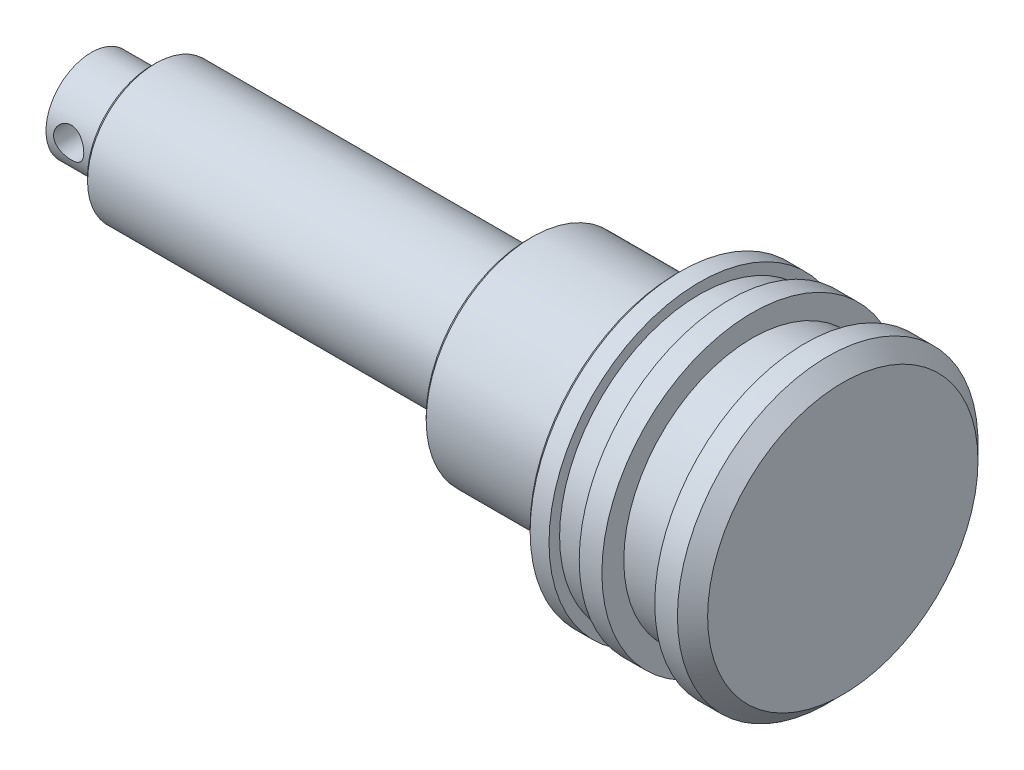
ISO-10303-21;
HEADER;
FILE_DESCRIPTION(('STEP AP214'),'2;1');
FILE_NAME('part.step','',(''),(''),'','','');
FILE_SCHEMA(('AUTOMOTIVE_DESIGN { 1 0 10303 214 1 1 1 1 }'));
ENDSEC;
DATA;
#1=APPLICATION_CONTEXT('core data for automotive mechanical design processes');
#2=APPLICATION_PROTOCOL_DEFINITION('international standard','automotive_design',2000,#1);
#3=PRODUCT_CONTEXT('',#1,'mechanical');
#4=PRODUCT('Part','Part','',(#3));
#5=PRODUCT_RELATED_PRODUCT_CATEGORY('part','',(#4));
#6=PRODUCT_DEFINITION_FORMATION('','',#4);
#7=PRODUCT_DEFINITION_CONTEXT('part definition',#1,'design');
#8=PRODUCT_DEFINITION('design','',#6,#7);
#9=PRODUCT_DEFINITION_SHAPE('','',#8);
#10=(LENGTH_UNIT() NAMED_UNIT(*) SI_UNIT(.MILLI.,.METRE.));
#11=(NAMED_UNIT(*) PLANE_ANGLE_UNIT() SI_UNIT($,.RADIAN.));
#12=(NAMED_UNIT(*) SI_UNIT($,.STERADIAN.) SOLID_ANGLE_UNIT());
#13=UNCERTAINTY_MEASURE_WITH_UNIT(LENGTH_MEASURE(1.E-05),#10,'distance_accuracy_value','');
#14=(GEOMETRIC_REPRESENTATION_CONTEXT(3) GLOBAL_UNCERTAINTY_ASSIGNED_CONTEXT((#13)) GLOBAL_UNIT_ASSIGNED_CONTEXT((#10,
#11,#12)) REPRESENTATION_CONTEXT('',''));
#15=CARTESIAN_POINT('',(0.,0.,0.));
#16=DIRECTION('',(0.,0.,1.));
#17=DIRECTION('',(1.,0.,0.));
#18=AXIS2_PLACEMENT_3D('',#15,#16,#17);
#19=CARTESIAN_POINT('',(0.,0.,0.));
#20=DIRECTION('',(-1.,0.,0.));
#21=DIRECTION('',(0.,0.,1.));
#22=AXIS2_PLACEMENT_3D('',#19,#20,#21);
#23=CYLINDRICAL_SURFACE('',#22,6.);
#24=CARTESIAN_POINT('',(-98.5,0.,-6.00000000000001));
#25=CARTESIAN_POINT('',(-98.5000005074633,0.109126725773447,-6.00000030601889));
#26=CARTESIAN_POINT('',(-98.4910394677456,0.2182503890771,-5.99699539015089));
#27=CARTESIAN_POINT('',(-98.4555417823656,0.433283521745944,-5.98530420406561));
#28=CARTESIAN_POINT('',(-98.4290033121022,0.539192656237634,-5.97661734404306));
#29=CARTESIAN_POINT('',(-98.3593615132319,0.744665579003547,-5.95450615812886));
#30=CARTESIAN_POINT('',(-98.3162858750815,0.84423965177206,-5.94108975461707));
#31=CARTESIAN_POINT('',(-98.2149176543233,1.03474987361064,-5.91088891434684));
#32=CARTESIAN_POINT('',(-98.1566220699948,1.12568431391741,-5.89410381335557));
#33=CARTESIAN_POINT('',(-98.0243483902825,1.29948335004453,-5.85828188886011));
#34=CARTESIAN_POINT('',(-97.949937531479,1.38200740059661,-5.8391911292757));
#35=CARTESIAN_POINT('',(-97.7884656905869,1.53366538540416,-5.80120629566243));
#36=CARTESIAN_POINT('',(-97.701401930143,1.60279637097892,-5.78231226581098));
#37=CARTESIAN_POINT('',(-97.5140297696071,1.72764988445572,-5.74626664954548));
#38=CARTESIAN_POINT('',(-97.4134125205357,1.78292971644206,-5.72918078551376));
#39=CARTESIAN_POINT('',(-97.2036478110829,1.87563774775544,-5.69950610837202));
#40=CARTESIAN_POINT('',(-97.0945029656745,1.91307139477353,-5.68691592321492));
#41=CARTESIAN_POINT('',(-96.8746535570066,1.96774692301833,-5.66822606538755));
#42=CARTESIAN_POINT('',(-96.7641255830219,1.98562689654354,-5.66192191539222));
#43=CARTESIAN_POINT('',(-96.5414724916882,2.00268224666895,-5.65591313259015));
#44=CARTESIAN_POINT('',(-96.4293478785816,2.00186340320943,-5.6562064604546));
#45=CARTESIAN_POINT('',(-96.212126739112,1.98203980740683,-5.66318030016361));
#46=CARTESIAN_POINT('',(-96.106943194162,1.96386782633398,-5.66956831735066));
#47=CARTESIAN_POINT('',(-95.9012131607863,1.91121232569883,-5.68753315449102));
#48=CARTESIAN_POINT('',(-95.8006672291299,1.87672685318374,-5.69911059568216));
#49=CARTESIAN_POINT('',(-95.6051745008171,1.79187811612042,-5.72635822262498));
#50=CARTESIAN_POINT('',(-95.510343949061,1.74126809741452,-5.74209131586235));
#51=CARTESIAN_POINT('',(-95.3302581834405,1.62577821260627,-5.77585117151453));
#52=CARTESIAN_POINT('',(-95.2450057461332,1.560894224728,-5.79387859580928));
#53=CARTESIAN_POINT('',(-95.0818168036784,1.41469866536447,-5.83134658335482));
#54=CARTESIAN_POINT('',(-95.0044946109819,1.33270630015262,-5.85081178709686));
#55=CARTESIAN_POINT('',(-94.8645374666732,1.15667913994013,-5.88813876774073));
#56=CARTESIAN_POINT('',(-94.801903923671,1.06264319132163,-5.90600039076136));
#57=CARTESIAN_POINT('',(-94.6926073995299,0.863895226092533,-5.93834215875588));
#58=CARTESIAN_POINT('',(-94.6461090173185,0.75908655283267,-5.95278700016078));
#59=CARTESIAN_POINT('',(-94.5715936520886,0.542538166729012,-5.9764113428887));
#60=CARTESIAN_POINT('',(-94.5435702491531,0.430800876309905,-5.98559267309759));
#61=CARTESIAN_POINT('',(-94.5078886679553,0.208767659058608,-5.99735254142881));
#62=CARTESIAN_POINT('',(-94.4994003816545,0.0986191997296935,-6.00020003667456));
#63=CARTESIAN_POINT('',(-94.5006653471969,-0.121550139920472,-5.99977805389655));
#64=CARTESIAN_POINT('',(-94.5104155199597,-0.231571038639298,-5.99650960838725));
#65=CARTESIAN_POINT('',(-94.5472238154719,-0.445039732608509,-5.98440049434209));
#66=CARTESIAN_POINT('',(-94.573772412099,-0.548585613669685,-5.97572397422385));
#67=CARTESIAN_POINT('',(-94.6427868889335,-0.749711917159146,-5.9538369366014));
#68=CARTESIAN_POINT('',(-94.6852547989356,-0.847291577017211,-5.94062584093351));
#69=CARTESIAN_POINT('',(-94.7861408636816,-1.03657659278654,-5.9105786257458));
#70=CARTESIAN_POINT('',(-94.8449491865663,-1.12805991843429,-5.89365629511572));
#71=CARTESIAN_POINT('',(-94.976388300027,-1.30012966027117,-5.85810507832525));
#72=CARTESIAN_POINT('',(-95.0490233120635,-1.38071273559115,-5.83947567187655));
#73=CARTESIAN_POINT('',(-95.2099575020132,-1.5325050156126,-5.8015369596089));
#74=CARTESIAN_POINT('',(-95.2988184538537,-1.60312193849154,-5.78223522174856));
#75=CARTESIAN_POINT('',(-95.4875431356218,-1.72851504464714,-5.74599946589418));
#76=CARTESIAN_POINT('',(-95.5874069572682,-1.78329109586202,-5.72906546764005));
#77=CARTESIAN_POINT('',(-95.7953460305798,-1.87519386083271,-5.69964783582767));
#78=CARTESIAN_POINT('',(-95.9034041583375,-1.91235626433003,-5.68715521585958));
#79=CARTESIAN_POINT('',(-96.1247573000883,-1.96778933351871,-5.66821664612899));
#80=CARTESIAN_POINT('',(-96.2380499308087,-1.98606850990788,-5.66176797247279));
#81=CARTESIAN_POINT('',(-96.4603941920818,-2.00255256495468,-5.65595717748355));
#82=CARTESIAN_POINT('',(-96.5693646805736,-2.0017405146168,-5.6562480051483));
#83=CARTESIAN_POINT('',(-96.7855301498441,-1.98248458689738,-5.66302539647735));
#84=CARTESIAN_POINT('',(-96.8927252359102,-1.96404175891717,-5.66951159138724));
#85=CARTESIAN_POINT('',(-97.1002713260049,-1.91074362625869,-5.68769048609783));
#86=CARTESIAN_POINT('',(-97.200713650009,-1.87620669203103,-5.69928196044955));
#87=CARTESIAN_POINT('',(-97.3944548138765,-1.79195873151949,-5.72632797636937));
#88=CARTESIAN_POINT('',(-97.487752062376,-1.74224433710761,-5.74178337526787));
#89=CARTESIAN_POINT('',(-97.6689673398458,-1.62652138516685,-5.77565658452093));
#90=CARTESIAN_POINT('',(-97.7564730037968,-1.55989648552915,-5.79417423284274));
#91=CARTESIAN_POINT('',(-97.9193796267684,-1.41328576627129,-5.83166712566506));
#92=CARTESIAN_POINT('',(-97.9947771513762,-1.33329616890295,-5.85064249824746));
#93=CARTESIAN_POINT('',(-98.1342888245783,-1.15848311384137,-5.88780061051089));
#94=CARTESIAN_POINT('',(-98.197848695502,-1.06320302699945,-5.90592363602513));
#95=CARTESIAN_POINT('',(-98.3079808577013,-0.862714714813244,-5.93851982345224));
#96=CARTESIAN_POINT('',(-98.3545574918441,-0.757509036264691,-5.9529939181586));
#97=CARTESIAN_POINT('',(-98.4274432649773,-0.544987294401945,-5.97611030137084));
#98=CARTESIAN_POINT('',(-98.4545649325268,-0.437975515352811,-5.98498424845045));
#99=CARTESIAN_POINT('',(-98.4908405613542,-0.22064083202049,-5.99692814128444));
#100=CARTESIAN_POINT('',(-98.4999994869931,-0.110318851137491,-5.99999969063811));
#101=CARTESIAN_POINT('',(-98.5,0.,-6.00000000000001));
#102=B_SPLINE_CURVE_WITH_KNOTS('',3,(#24,#25,#26,#27,#28,#29,#30,#31,#32,#33,#34,#35,#36,#37,
#38,#39,#40,#41,#42,#43,#44,#45,#46,#47,#48,#49,#50,#51,#52,#53,#54,#55,#56,#57,#58,#59,#60,#61,
#62,#63,#64,#65,#66,#67,#68,#69,#70,#71,#72,#73,#74,#75,#76,#77,#78,#79,#80,#81,#82,#83,#84,#85,
#86,#87,#88,#89,#90,#91,#92,#93,#94,#95,#96,#97,#98,#99,#100,#101),.UNSPECIFIED.,.T.,.F.,(4,2,2,
2,2,2,2,2,2,2,2,2,2,2,2,2,2,2,2,2,2,2,2,2,2,2,2,2,2,2,2,2,2,2,2,2,2,2,4),(0.,0.326974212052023,
0.653982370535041,0.980445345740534,1.30697275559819,1.64369368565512,1.98048866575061,
2.32696769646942,2.67334089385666,3.00803851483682,3.34263267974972,3.66193653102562,
3.98127861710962,4.30576342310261,4.63034205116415,4.97186611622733,5.31342291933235,
5.65836811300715,6.00319337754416,6.33307166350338,6.66289426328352,6.98316315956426,
7.30347290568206,7.63220799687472,7.96104361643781,8.30482045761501,8.64860016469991,
8.99168027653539,9.33460569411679,9.65991332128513,9.98520158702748,10.3043117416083,
10.6234927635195,10.9566013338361,11.2898042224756,11.635993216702,11.9820936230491,
12.3127311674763,12.6432773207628),.UNSPECIFIED.);
#103=CARTESIAN_POINT('',(-98.5,0.,-6.00000000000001));
#104=VERTEX_POINT('',#103);
#105=EDGE_CURVE('E64',#104,#104,#102,.T.);
#106=ORIENTED_EDGE('',*,*,#105,.F.);
#107=EDGE_LOOP('',(#106));
#108=FACE_BOUND('',#107,.T.);
#109=CARTESIAN_POINT('',(-99.5,0.,0.));
#110=DIRECTION('',(-1.,0.,0.));
#111=DIRECTION('',(0.,0.,1.));
#112=AXIS2_PLACEMENT_3D('',#109,#110,#111);
#113=CIRCLE('',#112,6.);
#114=CARTESIAN_POINT('',(-99.5,0.,6.));
#115=VERTEX_POINT('',#114);
#116=EDGE_CURVE('E56',#115,#115,#113,.T.);
#117=ORIENTED_EDGE('',*,*,#116,.F.);
#118=EDGE_LOOP('',(#117));
#119=FACE_BOUND('',#118,.T.);
#120=CARTESIAN_POINT('',(-91.5,0.,0.));
#121=DIRECTION('',(-1.,0.,0.));
#122=DIRECTION('',(0.,0.,1.));
#123=AXIS2_PLACEMENT_3D('',#120,#121,#122);
#124=CIRCLE('',#123,6.);
#125=CARTESIAN_POINT('',(-91.5,0.,6.00000000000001));
#126=VERTEX_POINT('',#125);
#127=EDGE_CURVE('E58',#126,#126,#124,.T.);
#128=ORIENTED_EDGE('',*,*,#127,.T.);
#129=EDGE_LOOP('',(#128));
#130=FACE_BOUND('',#129,.T.);
#131=CARTESIAN_POINT('',(-94.5,0.,6.00000000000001));
#132=CARTESIAN_POINT('',(-94.4999994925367,0.109126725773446,6.00000030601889));
#133=CARTESIAN_POINT('',(-94.5089605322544,0.218250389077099,5.99699539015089));
#134=CARTESIAN_POINT('',(-94.5444582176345,0.433283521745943,5.98530420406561));
#135=CARTESIAN_POINT('',(-94.5709966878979,0.539192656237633,5.97661734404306));
#136=CARTESIAN_POINT('',(-94.6406384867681,0.744665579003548,5.95450615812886));
#137=CARTESIAN_POINT('',(-94.6837141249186,0.844239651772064,5.94108975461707));
#138=CARTESIAN_POINT('',(-94.7850823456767,1.03474987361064,5.91088891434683));
#139=CARTESIAN_POINT('',(-94.8433779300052,1.12568431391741,5.89410381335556));
#140=CARTESIAN_POINT('',(-94.9756516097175,1.29948335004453,5.85828188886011));
#141=CARTESIAN_POINT('',(-95.050062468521,1.38200740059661,5.8391911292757));
#142=CARTESIAN_POINT('',(-95.2115343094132,1.53366538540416,5.80120629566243));
#143=CARTESIAN_POINT('',(-95.298598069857,1.60279637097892,5.78231226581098));
#144=CARTESIAN_POINT('',(-95.4859702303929,1.72764988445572,5.74626664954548));
#145=CARTESIAN_POINT('',(-95.5865874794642,1.78292971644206,5.72918078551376));
#146=CARTESIAN_POINT('',(-95.7963521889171,1.87563774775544,5.69950610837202));
#147=CARTESIAN_POINT('',(-95.9054970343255,1.91307139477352,5.68691592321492));
#148=CARTESIAN_POINT('',(-96.1253464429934,1.96774692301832,5.66822606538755));
#149=CARTESIAN_POINT('',(-96.2358744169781,1.98562689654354,5.66192191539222));
#150=CARTESIAN_POINT('',(-96.4585275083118,2.00268224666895,5.65591313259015));
#151=CARTESIAN_POINT('',(-96.5706521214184,2.00186340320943,5.6562064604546));
#152=CARTESIAN_POINT('',(-96.7878732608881,1.98203980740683,5.66318030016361));
#153=CARTESIAN_POINT('',(-96.8930568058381,1.96386782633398,5.66956831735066));
#154=CARTESIAN_POINT('',(-97.0987868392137,1.91121232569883,5.68753315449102));
#155=CARTESIAN_POINT('',(-97.1993327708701,1.87672685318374,5.69911059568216));
#156=CARTESIAN_POINT('',(-97.3948254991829,1.79187811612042,5.72635822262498));
#157=CARTESIAN_POINT('',(-97.489656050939,1.74126809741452,5.74209131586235));
#158=CARTESIAN_POINT('',(-97.6697418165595,1.62577821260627,5.77585117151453));
#159=CARTESIAN_POINT('',(-97.7549942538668,1.560894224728,5.79387859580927));
#160=CARTESIAN_POINT('',(-97.9181831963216,1.41469866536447,5.83134658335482));
#161=CARTESIAN_POINT('',(-97.9955053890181,1.33270630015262,5.85081178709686));
#162=CARTESIAN_POINT('',(-98.1354625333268,1.15667913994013,5.88813876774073));
#163=CARTESIAN_POINT('',(-98.198096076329,1.06264319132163,5.90600039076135));
#164=CARTESIAN_POINT('',(-98.3073926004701,0.863895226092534,5.93834215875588));
#165=CARTESIAN_POINT('',(-98.3538909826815,0.759086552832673,5.95278700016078));
#166=CARTESIAN_POINT('',(-98.4284063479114,0.542538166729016,5.9764113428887));
#167=CARTESIAN_POINT('',(-98.4564297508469,0.430800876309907,5.98559267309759));
#168=CARTESIAN_POINT('',(-98.4921113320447,0.208767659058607,5.99735254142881));
#169=CARTESIAN_POINT('',(-98.5005996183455,0.0986191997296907,6.00020003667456));
#170=CARTESIAN_POINT('',(-98.4993346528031,-0.121550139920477,5.99977805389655));
#171=CARTESIAN_POINT('',(-98.4895844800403,-0.231571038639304,5.99650960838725));
#172=CARTESIAN_POINT('',(-98.4527761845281,-0.445039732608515,5.98440049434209));
#173=CARTESIAN_POINT('',(-98.426227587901,-0.548585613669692,5.97572397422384));
#174=CARTESIAN_POINT('',(-98.3572131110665,-0.749711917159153,5.9538369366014));
#175=CARTESIAN_POINT('',(-98.3147452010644,-0.847291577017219,5.9406258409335));
#176=CARTESIAN_POINT('',(-98.2138591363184,-1.03657659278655,5.9105786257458));
#177=CARTESIAN_POINT('',(-98.1550508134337,-1.12805991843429,5.89365629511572));
#178=CARTESIAN_POINT('',(-98.023611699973,-1.30012966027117,5.85810507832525));
#179=CARTESIAN_POINT('',(-97.9509766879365,-1.38071273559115,5.83947567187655));
#180=CARTESIAN_POINT('',(-97.7900424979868,-1.5325050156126,5.8015369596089));
#181=CARTESIAN_POINT('',(-97.7011815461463,-1.60312193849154,5.78223522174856));
#182=CARTESIAN_POINT('',(-97.5124568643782,-1.72851504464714,5.74599946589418));
#183=CARTESIAN_POINT('',(-97.4125930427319,-1.78329109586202,5.72906546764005));
#184=CARTESIAN_POINT('',(-97.2046539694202,-1.87519386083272,5.69964783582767));
#185=CARTESIAN_POINT('',(-97.0965958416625,-1.91235626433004,5.68715521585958));
#186=CARTESIAN_POINT('',(-96.8752426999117,-1.96778933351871,5.66821664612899));
#187=CARTESIAN_POINT('',(-96.7619500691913,-1.98606850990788,5.66176797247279));
#188=CARTESIAN_POINT('',(-96.5396058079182,-2.00255256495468,5.65595717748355));
#189=CARTESIAN_POINT('',(-96.4306353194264,-2.0017405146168,5.6562480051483));
#190=CARTESIAN_POINT('',(-96.2144698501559,-1.98248458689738,5.66302539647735));
#191=CARTESIAN_POINT('',(-96.1072747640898,-1.96404175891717,5.66951159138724));
#192=CARTESIAN_POINT('',(-95.8997286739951,-1.91074362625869,5.68769048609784));
#193=CARTESIAN_POINT('',(-95.799286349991,-1.87620669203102,5.69928196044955));
#194=CARTESIAN_POINT('',(-95.6055451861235,-1.79195873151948,5.72632797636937));
#195=CARTESIAN_POINT('',(-95.512247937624,-1.7422443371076,5.74178337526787));
#196=CARTESIAN_POINT('',(-95.3310326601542,-1.62652138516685,5.77565658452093));
#197=CARTESIAN_POINT('',(-95.2435269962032,-1.55989648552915,5.79417423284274));
#198=CARTESIAN_POINT('',(-95.0806203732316,-1.41328576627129,5.83166712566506));
#199=CARTESIAN_POINT('',(-95.0052228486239,-1.33329616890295,5.85064249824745));
#200=CARTESIAN_POINT('',(-94.8657111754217,-1.15848311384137,5.88780061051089));
#201=CARTESIAN_POINT('',(-94.802151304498,-1.06320302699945,5.90592363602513));
#202=CARTESIAN_POINT('',(-94.6920191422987,-0.862714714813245,5.93851982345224));
#203=CARTESIAN_POINT('',(-94.6454425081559,-0.757509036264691,5.9529939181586));
#204=CARTESIAN_POINT('',(-94.5725567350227,-0.544987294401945,5.97611030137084));
#205=CARTESIAN_POINT('',(-94.5454350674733,-0.437975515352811,5.98498424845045));
#206=CARTESIAN_POINT('',(-94.5091594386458,-0.22064083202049,5.99692814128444));
#207=CARTESIAN_POINT('',(-94.5000005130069,-0.110318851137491,5.9999996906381));
#208=CARTESIAN_POINT('',(-94.5,0.,6.00000000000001));
#209=B_SPLINE_CURVE_WITH_KNOTS('',3,(#131,#132,#133,#134,#135,#136,#137,#138,#139,#140,#141,
#142,#143,#144,#145,#146,#147,#148,#149,#150,#151,#152,#153,#154,#155,#156,#157,#158,#159,#160,
#161,#162,#163,#164,#165,#166,#167,#168,#169,#170,#171,#172,#173,#174,#175,#176,#177,#178,#179,
#180,#181,#182,#183,#184,#185,#186,#187,#188,#189,#190,#191,#192,#193,#194,#195,#196,#197,#198,
#199,#200,#201,#202,#203,#204,#205,#206,#207,#208),.UNSPECIFIED.,.T.,.F.,(4,2,2,2,2,2,2,2,2,2,2,
2,2,2,2,2,2,2,2,2,2,2,2,2,2,2,2,2,2,2,2,2,2,2,2,2,2,2,4),(0.,0.326974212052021,
0.653982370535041,0.980445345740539,1.30697275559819,1.64369368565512,1.98048866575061,
2.32696769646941,2.67334089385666,3.00803851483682,3.34263267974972,3.66193653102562,
3.98127861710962,4.30576342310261,4.63034205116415,4.97186611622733,5.31342291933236,
5.65836811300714,6.00319337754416,6.33307166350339,6.66289426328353,6.98316315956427,
7.30347290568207,7.63220799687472,7.96104361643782,8.30482045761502,8.64860016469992,
8.9916802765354,9.33460569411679,9.65991332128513,9.98520158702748,10.3043117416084,
10.6234927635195,10.9566013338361,11.2898042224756,11.635993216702,11.9820936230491,
12.3127311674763,12.6432773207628),.UNSPECIFIED.);
#210=CARTESIAN_POINT('',(-94.5,0.,6.00000000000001));
#211=VERTEX_POINT('',#210);
#212=EDGE_CURVE('E36',#211,#211,#209,.T.);
#213=ORIENTED_EDGE('',*,*,#212,.F.);
#214=EDGE_LOOP('',(#213));
#215=FACE_BOUND('',#214,.T.);
#216=ADVANCED_FACE('F32',(#108,#119,#130,#215),#23,.T.);
#217=CARTESIAN_POINT('',(0.,0.,0.));
#218=DIRECTION('',(-1.,0.,0.));
#219=DIRECTION('',(0.,0.,1.));
#220=AXIS2_PLACEMENT_3D('',#217,#218,#219);
#221=PLANE('',#220);
#222=CARTESIAN_POINT('',(0.,0.,0.));
#223=DIRECTION('',(-1.,0.,0.));
#224=DIRECTION('',(0.,0.,1.));
#225=AXIS2_PLACEMENT_3D('',#222,#223,#224);
#226=CIRCLE('',#225,17.9000000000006);
#227=CARTESIAN_POINT('',(0.,0.,17.9000000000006));
#228=VERTEX_POINT('',#227);
#229=EDGE_CURVE('E11',#228,#228,#226,.T.);
#230=ORIENTED_EDGE('',*,*,#229,.F.);
#231=EDGE_LOOP('',(#230));
#232=FACE_BOUND('',#231,.T.);
#233=ADVANCED_FACE('F34',(#232),#221,.F.);
#234=CARTESIAN_POINT('',(0.,0.,0.));
#235=DIRECTION('',(-1.,0.,0.));
#236=DIRECTION('',(0.,0.,1.));
#237=AXIS2_PLACEMENT_3D('',#234,#235,#236);
#238=CONICAL_SURFACE('',#237,17.9000000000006,0.785398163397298);
#239=CARTESIAN_POINT('',(-2.,0.,0.));
#240=DIRECTION('',(-1.,0.,0.));
#241=DIRECTION('',(0.,0.,1.));
#242=AXIS2_PLACEMENT_3D('',#239,#240,#241);
#243=CIRCLE('',#242,19.9);
#244=CARTESIAN_POINT('',(-2.,0.,19.9));
#245=VERTEX_POINT('',#244);
#246=EDGE_CURVE('E44',#245,#245,#243,.T.);
#247=ORIENTED_EDGE('',*,*,#246,.F.);
#248=EDGE_LOOP('',(#247));
#249=FACE_BOUND('',#248,.T.);
#250=ORIENTED_EDGE('',*,*,#229,.T.);
#251=EDGE_LOOP('',(#250));
#252=FACE_BOUND('',#251,.T.);
#253=ADVANCED_FACE('F132',(#249,#252),#238,.T.);
#254=CARTESIAN_POINT('',(0.,0.,0.));
#255=DIRECTION('',(-1.,0.,0.));
#256=DIRECTION('',(0.,0.,1.));
#257=AXIS2_PLACEMENT_3D('',#254,#255,#256);
#258=CYLINDRICAL_SURFACE('',#257,19.9);
#259=CARTESIAN_POINT('',(-5.,0.,0.));
#260=DIRECTION('',(-1.,0.,0.));
#261=DIRECTION('',(0.,0.,1.));
#262=AXIS2_PLACEMENT_3D('',#259,#260,#261);
#263=CIRCLE('',#262,19.9);
#264=CARTESIAN_POINT('',(-5.,0.,19.9));
#265=VERTEX_POINT('',#264);
#266=EDGE_CURVE('E111',#265,#265,#263,.T.);
#267=ORIENTED_EDGE('',*,*,#266,.F.);
#268=EDGE_LOOP('',(#267));
#269=FACE_BOUND('',#268,.T.);
#270=ORIENTED_EDGE('',*,*,#246,.T.);
#271=EDGE_LOOP('',(#270));
#272=FACE_BOUND('',#271,.T.);
#273=ADVANCED_FACE('F231',(#269,#272),#258,.T.);
#274=CARTESIAN_POINT('',(-5.,19.9,0.));
#275=DIRECTION('',(1.,0.,0.));
#276=DIRECTION('',(0.,0.,-1.));
#277=AXIS2_PLACEMENT_3D('',#274,#275,#276);
#278=PLANE('',#277);
#279=CARTESIAN_POINT('',(-5.,0.,0.));
#280=DIRECTION('',(-1.,0.,0.));
#281=DIRECTION('',(0.,0.,1.));
#282=AXIS2_PLACEMENT_3D('',#279,#280,#281);
#283=CIRCLE('',#282,17.);
#284=CARTESIAN_POINT('',(-5.,0.,17.));
#285=VERTEX_POINT('',#284);
#286=EDGE_CURVE('E108',#285,#285,#283,.T.);
#287=ORIENTED_EDGE('',*,*,#286,.F.);
#288=EDGE_LOOP('',(#287));
#289=FACE_BOUND('',#288,.T.);
#290=ORIENTED_EDGE('',*,*,#266,.T.);
#291=EDGE_LOOP('',(#290));
#292=FACE_BOUND('',#291,.T.);
#293=ADVANCED_FACE('F225',(#289,#292),#278,.F.);
#294=CARTESIAN_POINT('',(0.,0.,0.));
#295=DIRECTION('',(-1.,0.,0.));
#296=DIRECTION('',(0.,0.,1.));
#297=AXIS2_PLACEMENT_3D('',#294,#295,#296);
#298=CYLINDRICAL_SURFACE('',#297,17.);
#299=CARTESIAN_POINT('',(-12.,0.,0.));
#300=DIRECTION('',(-1.,0.,0.));
#301=DIRECTION('',(0.,0.,1.));
#302=AXIS2_PLACEMENT_3D('',#299,#300,#301);
#303=CIRCLE('',#302,17.);
#304=CARTESIAN_POINT('',(-12.,0.,17.));
#305=VERTEX_POINT('',#304);
#306=EDGE_CURVE('E105',#305,#305,#303,.T.);
#307=ORIENTED_EDGE('',*,*,#306,.F.);
#308=EDGE_LOOP('',(#307));
#309=FACE_BOUND('',#308,.T.);
#310=ORIENTED_EDGE('',*,*,#286,.T.);
#311=EDGE_LOOP('',(#310));
#312=FACE_BOUND('',#311,.T.);
#313=ADVANCED_FACE('F219',(#309,#312),#298,.T.);
#314=CARTESIAN_POINT('',(-12.,17.,0.));
#315=DIRECTION('',(-1.,0.,0.));
#316=DIRECTION('',(0.,0.,1.));
#317=AXIS2_PLACEMENT_3D('',#314,#315,#316);
#318=PLANE('',#317);
#319=CARTESIAN_POINT('',(-12.,0.,0.));
#320=DIRECTION('',(-1.,0.,0.));
#321=DIRECTION('',(0.,0.,1.));
#322=AXIS2_PLACEMENT_3D('',#319,#320,#321);
#323=CIRCLE('',#322,19.9);
#324=CARTESIAN_POINT('',(-12.,0.,19.9));
#325=VERTEX_POINT('',#324);
#326=EDGE_CURVE('E102',#325,#325,#323,.T.);
#327=ORIENTED_EDGE('',*,*,#326,.F.);
#328=EDGE_LOOP('',(#327));
#329=FACE_BOUND('',#328,.T.);
#330=ORIENTED_EDGE('',*,*,#306,.T.);
#331=EDGE_LOOP('',(#330));
#332=FACE_BOUND('',#331,.T.);
#333=ADVANCED_FACE('F213',(#329,#332),#318,.F.);
#334=CARTESIAN_POINT('',(0.,0.,0.));
#335=DIRECTION('',(-1.,0.,0.));
#336=DIRECTION('',(0.,0.,1.));
#337=AXIS2_PLACEMENT_3D('',#334,#335,#336);
#338=CYLINDRICAL_SURFACE('',#337,19.9);
#339=CARTESIAN_POINT('',(-15.,0.,0.));
#340=DIRECTION('',(-1.,0.,0.));
#341=DIRECTION('',(0.,0.,1.));
#342=AXIS2_PLACEMENT_3D('',#339,#340,#341);
#343=CIRCLE('',#342,19.9);
#344=CARTESIAN_POINT('',(-15.,0.,19.9));
#345=VERTEX_POINT('',#344);
#346=EDGE_CURVE('E99',#345,#345,#343,.T.);
#347=ORIENTED_EDGE('',*,*,#346,.F.);
#348=EDGE_LOOP('',(#347));
#349=FACE_BOUND('',#348,.T.);
#350=ORIENTED_EDGE('',*,*,#326,.T.);
#351=EDGE_LOOP('',(#350));
#352=FACE_BOUND('',#351,.T.);
#353=ADVANCED_FACE('F207',(#349,#352),#338,.T.);
#354=CARTESIAN_POINT('',(-15.,19.9,0.));
#355=DIRECTION('',(1.,0.,0.));
#356=DIRECTION('',(0.,0.,-1.));
#357=AXIS2_PLACEMENT_3D('',#354,#355,#356);
#358=PLANE('',#357);
#359=CARTESIAN_POINT('',(-15.,0.,0.));
#360=DIRECTION('',(-1.,0.,0.));
#361=DIRECTION('',(0.,0.,1.));
#362=AXIS2_PLACEMENT_3D('',#359,#360,#361);
#363=CIRCLE('',#362,18.5);
#364=CARTESIAN_POINT('',(-15.,0.,18.5));
#365=VERTEX_POINT('',#364);
#366=EDGE_CURVE('E95',#365,#365,#363,.T.);
#367=ORIENTED_EDGE('',*,*,#366,.F.);
#368=EDGE_LOOP('',(#367));
#369=FACE_BOUND('',#368,.T.);
#370=ORIENTED_EDGE('',*,*,#346,.T.);
#371=EDGE_LOOP('',(#370));
#372=FACE_BOUND('',#371,.T.);
#373=ADVANCED_FACE('F201',(#369,#372),#358,.F.);
#374=CARTESIAN_POINT('',(0.,0.,0.));
#375=DIRECTION('',(-1.,0.,0.));
#376=DIRECTION('',(0.,0.,1.));
#377=AXIS2_PLACEMENT_3D('',#374,#375,#376);
#378=CYLINDRICAL_SURFACE('',#377,18.5);
#379=CARTESIAN_POINT('',(-19.,0.,0.));
#380=DIRECTION('',(-1.,0.,0.));
#381=DIRECTION('',(0.,0.,1.));
#382=AXIS2_PLACEMENT_3D('',#379,#380,#381);
#383=CIRCLE('',#382,18.5);
#384=CARTESIAN_POINT('',(-19.,0.,18.5));
#385=VERTEX_POINT('',#384);
#386=EDGE_CURVE('E92',#385,#385,#383,.T.);
#387=ORIENTED_EDGE('',*,*,#386,.F.);
#388=EDGE_LOOP('',(#387));
#389=FACE_BOUND('',#388,.T.);
#390=ORIENTED_EDGE('',*,*,#366,.T.);
#391=EDGE_LOOP('',(#390));
#392=FACE_BOUND('',#391,.T.);
#393=ADVANCED_FACE('F195',(#389,#392),#378,.T.);
#394=CARTESIAN_POINT('',(-19.,18.5,0.));
#395=DIRECTION('',(-1.,0.,0.));
#396=DIRECTION('',(0.,0.,1.));
#397=AXIS2_PLACEMENT_3D('',#394,#395,#396);
#398=PLANE('',#397);
#399=CARTESIAN_POINT('',(-19.,0.,0.));
#400=DIRECTION('',(-1.,0.,0.));
#401=DIRECTION('',(0.,0.,1.));
#402=AXIS2_PLACEMENT_3D('',#399,#400,#401);
#403=CIRCLE('',#402,19.9);
#404=CARTESIAN_POINT('',(-19.,0.,19.9));
#405=VERTEX_POINT('',#404);
#406=EDGE_CURVE('E89',#405,#405,#403,.T.);
#407=ORIENTED_EDGE('',*,*,#406,.F.);
#408=EDGE_LOOP('',(#407));
#409=FACE_BOUND('',#408,.T.);
#410=ORIENTED_EDGE('',*,*,#386,.T.);
#411=EDGE_LOOP('',(#410));
#412=FACE_BOUND('',#411,.T.);
#413=ADVANCED_FACE('F189',(#409,#412),#398,.F.);
#414=CARTESIAN_POINT('',(0.,0.,0.));
#415=DIRECTION('',(-1.,0.,0.));
#416=DIRECTION('',(0.,0.,1.));
#417=AXIS2_PLACEMENT_3D('',#414,#415,#416);
#418=CYLINDRICAL_SURFACE('',#417,19.9);
#419=CARTESIAN_POINT('',(-21.5,0.,0.));
#420=DIRECTION('',(-1.,0.,0.));
#421=DIRECTION('',(0.,0.,1.));
#422=AXIS2_PLACEMENT_3D('',#419,#420,#421);
#423=CIRCLE('',#422,19.9);
#424=CARTESIAN_POINT('',(-21.5,0.,19.9));
#425=VERTEX_POINT('',#424);
#426=EDGE_CURVE('E86',#425,#425,#423,.T.);
#427=ORIENTED_EDGE('',*,*,#426,.F.);
#428=EDGE_LOOP('',(#427));
#429=FACE_BOUND('',#428,.T.);
#430=ORIENTED_EDGE('',*,*,#406,.T.);
#431=EDGE_LOOP('',(#430));
#432=FACE_BOUND('',#431,.T.);
#433=ADVANCED_FACE('F183',(#429,#432),#418,.T.);
#434=CARTESIAN_POINT('',(-21.5,0.,0.));
#435=DIRECTION('',(1.,0.,0.));
#436=DIRECTION('',(0.,0.,-1.));
#437=AXIS2_PLACEMENT_3D('',#434,#435,#436);
#438=CONICAL_SURFACE('',#437,19.9,0.785398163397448);
#439=CARTESIAN_POINT('',(-22.,0.,0.));
#440=DIRECTION('',(-1.,0.,0.));
#441=DIRECTION('',(0.,0.,1.));
#442=AXIS2_PLACEMENT_3D('',#439,#440,#441);
#443=CIRCLE('',#442,19.4);
#444=CARTESIAN_POINT('',(-22.,0.,19.4));
#445=VERTEX_POINT('',#444);
#446=EDGE_CURVE('E83',#445,#445,#443,.T.);
#447=ORIENTED_EDGE('',*,*,#446,.F.);
#448=EDGE_LOOP('',(#447));
#449=FACE_BOUND('',#448,.T.);
#450=ORIENTED_EDGE('',*,*,#426,.T.);
#451=EDGE_LOOP('',(#450));
#452=FACE_BOUND('',#451,.T.);
#453=ADVANCED_FACE('F177',(#449,#452),#438,.T.);
#454=CARTESIAN_POINT('',(-22.,19.4,0.));
#455=DIRECTION('',(1.,0.,0.));
#456=DIRECTION('',(0.,0.,-1.));
#457=AXIS2_PLACEMENT_3D('',#454,#455,#456);
#458=PLANE('',#457);
#459=CARTESIAN_POINT('',(-22.,0.,0.));
#460=DIRECTION('',(-1.,0.,0.));
#461=DIRECTION('',(0.,0.,1.));
#462=AXIS2_PLACEMENT_3D('',#459,#460,#461);
#463=CIRCLE('',#462,14.);
#464=CARTESIAN_POINT('',(-22.,0.,14.));
#465=VERTEX_POINT('',#464);
#466=EDGE_CURVE('E80',#465,#465,#463,.T.);
#467=ORIENTED_EDGE('',*,*,#466,.F.);
#468=EDGE_LOOP('',(#467));
#469=FACE_BOUND('',#468,.T.);
#470=ORIENTED_EDGE('',*,*,#446,.T.);
#471=EDGE_LOOP('',(#470));
#472=FACE_BOUND('',#471,.T.);
#473=ADVANCED_FACE('F171',(#469,#472),#458,.F.);
#474=CARTESIAN_POINT('',(0.,0.,0.));
#475=DIRECTION('',(-1.,0.,0.));
#476=DIRECTION('',(0.,0.,1.));
#477=AXIS2_PLACEMENT_3D('',#474,#475,#476);
#478=CYLINDRICAL_SURFACE('',#477,14.);
#479=CARTESIAN_POINT('',(-41.16,0.,0.));
#480=DIRECTION('',(-1.,0.,0.));
#481=DIRECTION('',(0.,0.,1.));
#482=AXIS2_PLACEMENT_3D('',#479,#480,#481);
#483=CIRCLE('',#482,14.);
#484=CARTESIAN_POINT('',(-41.16,0.,14.));
#485=VERTEX_POINT('',#484);
#486=EDGE_CURVE('E77',#485,#485,#483,.T.);
#487=ORIENTED_EDGE('',*,*,#486,.F.);
#488=EDGE_LOOP('',(#487));
#489=FACE_BOUND('',#488,.T.);
#490=ORIENTED_EDGE('',*,*,#466,.T.);
#491=EDGE_LOOP('',(#490));
#492=FACE_BOUND('',#491,.T.);
#493=ADVANCED_FACE('F165',(#489,#492),#478,.T.);
#494=CARTESIAN_POINT('',(-41.16,0.,0.));
#495=DIRECTION('',(1.,0.,0.));
#496=DIRECTION('',(0.,0.,-1.));
#497=AXIS2_PLACEMENT_3D('',#494,#495,#496);
#498=CONICAL_SURFACE('',#497,14.,0.785398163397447);
#499=CARTESIAN_POINT('',(-41.66,0.,0.));
#500=DIRECTION('',(-1.,0.,0.));
#501=DIRECTION('',(0.,0.,1.));
#502=AXIS2_PLACEMENT_3D('',#499,#500,#501);
#503=CIRCLE('',#502,13.5);
#504=CARTESIAN_POINT('',(-41.66,0.,13.5));
#505=VERTEX_POINT('',#504);
#506=EDGE_CURVE('E74',#505,#505,#503,.T.);
#507=ORIENTED_EDGE('',*,*,#506,.F.);
#508=EDGE_LOOP('',(#507));
#509=FACE_BOUND('',#508,.T.);
#510=ORIENTED_EDGE('',*,*,#486,.T.);
#511=EDGE_LOOP('',(#510));
#512=FACE_BOUND('',#511,.T.);
#513=ADVANCED_FACE('F159',(#509,#512),#498,.T.);
#514=CARTESIAN_POINT('',(-41.66,13.5,0.));
#515=DIRECTION('',(1.,0.,0.));
#516=DIRECTION('',(0.,0.,-1.));
#517=AXIS2_PLACEMENT_3D('',#514,#515,#516);
#518=PLANE('',#517);
#519=CARTESIAN_POINT('',(-41.66,0.,0.));
#520=DIRECTION('',(-1.,0.,0.));
#521=DIRECTION('',(0.,0.,1.));
#522=AXIS2_PLACEMENT_3D('',#519,#520,#521);
#523=CIRCLE('',#522,9.);
#524=CARTESIAN_POINT('',(-41.66,0.,9.00000000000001));
#525=VERTEX_POINT('',#524);
#526=EDGE_CURVE('E71',#525,#525,#523,.T.);
#527=ORIENTED_EDGE('',*,*,#526,.F.);
#528=EDGE_LOOP('',(#527));
#529=FACE_BOUND('',#528,.T.);
#530=ORIENTED_EDGE('',*,*,#506,.T.);
#531=EDGE_LOOP('',(#530));
#532=FACE_BOUND('',#531,.T.);
#533=ADVANCED_FACE('F153',(#529,#532),#518,.F.);
#534=CARTESIAN_POINT('',(0.,0.,0.));
#535=DIRECTION('',(-1.,0.,0.));
#536=DIRECTION('',(0.,0.,1.));
#537=AXIS2_PLACEMENT_3D('',#534,#535,#536);
#538=CYLINDRICAL_SURFACE('',#537,9.);
#539=CARTESIAN_POINT('',(-91.,0.,0.));
#540=DIRECTION('',(-1.,0.,0.));
#541=DIRECTION('',(0.,0.,1.));
#542=AXIS2_PLACEMENT_3D('',#539,#540,#541);
#543=CIRCLE('',#542,8.99999999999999);
#544=CARTESIAN_POINT('',(-91.,0.,9.));
#545=VERTEX_POINT('',#544);
#546=EDGE_CURVE('E68',#545,#545,#543,.T.);
#547=ORIENTED_EDGE('',*,*,#546,.F.);
#548=EDGE_LOOP('',(#547));
#549=FACE_BOUND('',#548,.T.);
#550=ORIENTED_EDGE('',*,*,#526,.T.);
#551=EDGE_LOOP('',(#550));
#552=FACE_BOUND('',#551,.T.);
#553=ADVANCED_FACE('F147',(#549,#552),#538,.T.);
#554=CARTESIAN_POINT('',(-91.,0.,0.));
#555=DIRECTION('',(1.,0.,0.));
#556=DIRECTION('',(0.,0.,-1.));
#557=AXIS2_PLACEMENT_3D('',#554,#555,#556);
#558=CONICAL_SURFACE('',#557,8.99999999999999,0.785398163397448);
#559=CARTESIAN_POINT('',(-91.5,0.,0.));
#560=DIRECTION('',(-1.,0.,0.));
#561=DIRECTION('',(0.,0.,1.));
#562=AXIS2_PLACEMENT_3D('',#559,#560,#561);
#563=CIRCLE('',#562,8.49999999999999);
#564=CARTESIAN_POINT('',(-91.5,0.,8.5));
#565=VERTEX_POINT('',#564);
#566=EDGE_CURVE('E61',#565,#565,#563,.T.);
#567=ORIENTED_EDGE('',*,*,#566,.F.);
#568=EDGE_LOOP('',(#567));
#569=FACE_BOUND('',#568,.T.);
#570=ORIENTED_EDGE('',*,*,#546,.T.);
#571=EDGE_LOOP('',(#570));
#572=FACE_BOUND('',#571,.T.);
#573=ADVANCED_FACE('F142',(#569,#572),#558,.T.);
#574=CARTESIAN_POINT('',(-91.5,8.50000000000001,0.));
#575=DIRECTION('',(1.,0.,0.));
#576=DIRECTION('',(0.,0.,-1.));
#577=AXIS2_PLACEMENT_3D('',#574,#575,#576);
#578=PLANE('',#577);
#579=ORIENTED_EDGE('',*,*,#127,.F.);
#580=EDGE_LOOP('',(#579));
#581=FACE_BOUND('',#580,.T.);
#582=ORIENTED_EDGE('',*,*,#566,.T.);
#583=EDGE_LOOP('',(#582));
#584=FACE_BOUND('',#583,.T.);
#585=ADVANCED_FACE('F52',(#581,#584),#578,.F.);
#586=CARTESIAN_POINT('',(-99.5,0.,0.));
#587=DIRECTION('',(1.,0.,0.));
#588=DIRECTION('',(0.,0.,-1.));
#589=AXIS2_PLACEMENT_3D('',#586,#587,#588);
#590=CONICAL_SURFACE('',#589,6.,1.17600520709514);
#591=CARTESIAN_POINT('',(-102.,0.,0.));
#592=VERTEX_POINT('',#591);
#593=VERTEX_LOOP('',#592);
#594=FACE_BOUND('',#593,.T.);
#595=ORIENTED_EDGE('',*,*,#116,.T.);
#596=EDGE_LOOP('',(#595));
#597=FACE_BOUND('',#596,.T.);
#598=ADVANCED_FACE('F48',(#594,#597),#590,.T.);
#599=CARTESIAN_POINT('',(-96.5,0.,19.9));
#600=DIRECTION('',(0.,0.,-1.));
#601=DIRECTION('',(-1.,0.,0.));
#602=AXIS2_PLACEMENT_3D('',#599,#600,#601);
#603=CYLINDRICAL_SURFACE('',#602,2.);
#604=ORIENTED_EDGE('',*,*,#105,.T.);
#605=EDGE_LOOP('',(#604));
#606=FACE_BOUND('',#605,.T.);
#607=ORIENTED_EDGE('',*,*,#212,.T.);
#608=EDGE_LOOP('',(#607));
#609=FACE_BOUND('',#608,.T.);
#610=ADVANCED_FACE('F51',(#606,#609),#603,.F.);
#611=CLOSED_SHELL('',(#216,#233,#253,#273,#293,#313,#333,#353,#373,#393,#413,#433,#453,#473,
#493,#513,#533,#553,#573,#585,#598,#610));
#612=MANIFOLD_SOLID_BREP('B2',#611);
#613=ADVANCED_BREP_SHAPE_REPRESENTATION('',(#18,#612),#14);
#614=SHAPE_DEFINITION_REPRESENTATION(#9,#613);
ENDSEC;
END-ISO-10303-21;
